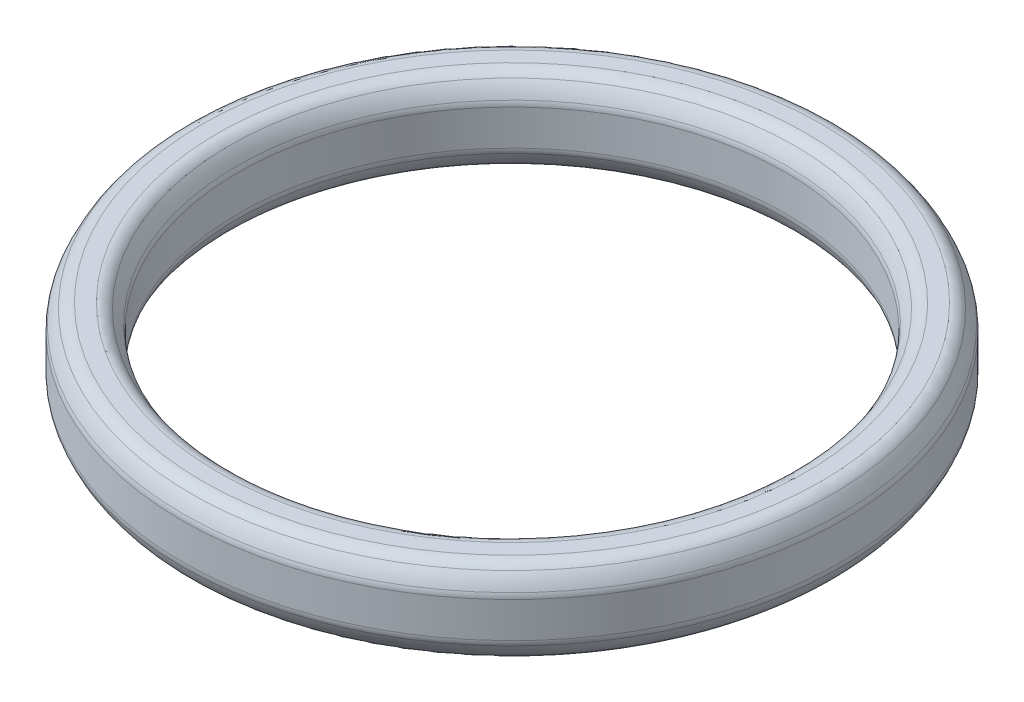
ISO-10303-21;
HEADER;
FILE_DESCRIPTION(('STEP AP214'),'2;1');
FILE_NAME('part.step','',(''),(''),'','','');
FILE_SCHEMA(('AUTOMOTIVE_DESIGN { 1 0 10303 214 1 1 1 1 }'));
ENDSEC;
DATA;
#1=APPLICATION_CONTEXT('core data for automotive mechanical design processes');
#2=APPLICATION_PROTOCOL_DEFINITION('international standard','automotive_design',2000,#1);
#3=PRODUCT_CONTEXT('',#1,'mechanical');
#4=PRODUCT('Part','Part','',(#3));
#5=PRODUCT_RELATED_PRODUCT_CATEGORY('part','',(#4));
#6=PRODUCT_DEFINITION_FORMATION('','',#4);
#7=PRODUCT_DEFINITION_CONTEXT('part definition',#1,'design');
#8=PRODUCT_DEFINITION('design','',#6,#7);
#9=PRODUCT_DEFINITION_SHAPE('','',#8);
#10=(LENGTH_UNIT() NAMED_UNIT(*) SI_UNIT(.MILLI.,.METRE.));
#11=(NAMED_UNIT(*) PLANE_ANGLE_UNIT() SI_UNIT($,.RADIAN.));
#12=(NAMED_UNIT(*) SI_UNIT($,.STERADIAN.) SOLID_ANGLE_UNIT());
#13=UNCERTAINTY_MEASURE_WITH_UNIT(LENGTH_MEASURE(1.E-05),#10,'distance_accuracy_value','');
#14=(GEOMETRIC_REPRESENTATION_CONTEXT(3) GLOBAL_UNCERTAINTY_ASSIGNED_CONTEXT((#13)) GLOBAL_UNIT_ASSIGNED_CONTEXT((#10,
#11,#12)) REPRESENTATION_CONTEXT('',''));
#15=CARTESIAN_POINT('',(0.,0.,0.));
#16=DIRECTION('',(0.,0.,1.));
#17=DIRECTION('',(1.,0.,0.));
#18=AXIS2_PLACEMENT_3D('',#15,#16,#17);
#19=CARTESIAN_POINT('',(15.5375,2.16,0.));
#20=DIRECTION('',(0.,0.,1.));
#21=DIRECTION('',(0.,-1.,0.));
#22=AXIS2_PLACEMENT_3D('',#19,#20,#21);
#23=ELLIPSE('',#22,2.4,1.59722222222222);
#24=CARTESIAN_POINT('',(0.,0.,0.));
#25=DIRECTION('',(0.,-1.,0.));
#26=AXIS1_PLACEMENT('',#24,#25);
#27=SURFACE_OF_REVOLUTION('',#23,#26);
#28=CARTESIAN_POINT('',(0.,4.04948495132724,0.));
#29=DIRECTION('',(0.,-1.,0.));
#30=DIRECTION('',(0.,0.,-1.));
#31=AXIS2_PLACEMENT_3D('',#28,#29,#30);
#32=CIRCLE('',#31,16.5223292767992);
#33=CARTESIAN_POINT('',(0.,4.04948495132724,-16.5223292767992));
#34=VERTEX_POINT('',#33);
#35=EDGE_CURVE('E64',#34,#34,#32,.T.);
#36=ORIENTED_EDGE('',*,*,#35,.T.);
#37=EDGE_LOOP('',(#36));
#38=FACE_BOUND('',#37,.T.);
#39=CARTESIAN_POINT('',(0.,3.34858375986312,0.));
#40=DIRECTION('',(0.,-1.,0.));
#41=DIRECTION('',(0.,0.,-1.));
#42=AXIS2_PLACEMENT_3D('',#39,#40,#41);
#43=CIRCLE('',#42,16.9250937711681);
#44=CARTESIAN_POINT('',(0.,3.34858375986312,-16.9250937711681));
#45=VERTEX_POINT('',#44);
#46=EDGE_CURVE('E67',#45,#45,#43,.F.);
#47=ORIENTED_EDGE('',*,*,#46,.T.);
#48=EDGE_LOOP('',(#47));
#49=FACE_BOUND('',#48,.T.);
#50=ADVANCED_FACE('F14',(#38,#49),#27,.F.);
#51=CARTESIAN_POINT('',(14.8412869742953,4.31999999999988,0.));
#52=DIRECTION('',(0.,1.,0.));
#53=DIRECTION('',(0.,0.,1.));
#54=AXIS2_PLACEMENT_3D('',#51,#52,#53);
#55=PLANE('',#54);
#56=CARTESIAN_POINT('',(0.,4.31999999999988,0.));
#57=DIRECTION('',(0.,1.,0.));
#58=DIRECTION('',(0.,0.,1.));
#59=AXIS2_PLACEMENT_3D('',#56,#57,#58);
#60=CIRCLE('',#59,15.9374684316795);
#61=CARTESIAN_POINT('',(0.,4.31999999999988,15.9374684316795));
#62=VERTEX_POINT('',#61);
#63=EDGE_CURVE('E58',#62,#62,#60,.T.);
#64=ORIENTED_EDGE('',*,*,#63,.T.);
#65=EDGE_LOOP('',(#64));
#66=FACE_BOUND('',#65,.T.);
#67=CARTESIAN_POINT('',(0.,4.31999999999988,0.));
#68=DIRECTION('',(0.,1.,0.));
#69=DIRECTION('',(0.,0.,1.));
#70=AXIS2_PLACEMENT_3D('',#67,#68,#69);
#71=CIRCLE('',#70,15.1375315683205);
#72=CARTESIAN_POINT('',(0.,4.31999999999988,15.1375315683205));
#73=VERTEX_POINT('',#72);
#74=EDGE_CURVE('E61',#73,#73,#71,.F.);
#75=ORIENTED_EDGE('',*,*,#74,.T.);
#76=EDGE_LOOP('',(#75));
#77=FACE_BOUND('',#76,.T.);
#78=ADVANCED_FACE('F96',(#66,#77),#55,.T.);
#79=CARTESIAN_POINT('',(15.5375,2.16,0.));
#80=DIRECTION('',(0.,0.,1.));
#81=DIRECTION('',(0.,-1.,0.));
#82=AXIS2_PLACEMENT_3D('',#79,#80,#81);
#83=ELLIPSE('',#82,2.4,1.59722222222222);
#84=CARTESIAN_POINT('',(0.,0.,0.));
#85=DIRECTION('',(0.,-1.,0.));
#86=AXIS1_PLACEMENT('',#84,#85);
#87=SURFACE_OF_REVOLUTION('',#83,#86);
#88=CARTESIAN_POINT('',(0.,4.04948495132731,0.));
#89=DIRECTION('',(0.,-1.,0.));
#90=DIRECTION('',(0.,0.,-1.));
#91=AXIS2_PLACEMENT_3D('',#88,#89,#90);
#92=CIRCLE('',#91,14.5526707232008);
#93=CARTESIAN_POINT('',(0.,4.04948495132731,-14.5526707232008));
#94=VERTEX_POINT('',#93);
#95=EDGE_CURVE('E52',#94,#94,#92,.F.);
#96=ORIENTED_EDGE('',*,*,#95,.T.);
#97=EDGE_LOOP('',(#96));
#98=FACE_BOUND('',#97,.T.);
#99=CARTESIAN_POINT('',(0.,3.34858375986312,0.));
#100=DIRECTION('',(0.,-1.,0.));
#101=DIRECTION('',(0.,0.,-1.));
#102=AXIS2_PLACEMENT_3D('',#99,#100,#101);
#103=CIRCLE('',#102,14.1499062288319);
#104=CARTESIAN_POINT('',(0.,3.34858375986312,-14.1499062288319));
#105=VERTEX_POINT('',#104);
#106=EDGE_CURVE('E55',#105,#105,#103,.T.);
#107=ORIENTED_EDGE('',*,*,#106,.T.);
#108=EDGE_LOOP('',(#107));
#109=FACE_BOUND('',#108,.T.);
#110=ADVANCED_FACE('F92',(#98,#109),#87,.F.);
#111=CARTESIAN_POINT('',(0.,0.,0.));
#112=DIRECTION('',(0.,-1.,0.));
#113=DIRECTION('',(0.,0.,-1.));
#114=AXIS2_PLACEMENT_3D('',#111,#112,#113);
#115=CYLINDRICAL_SURFACE('',#114,14.1);
#116=CARTESIAN_POINT('',(0.,3.07634226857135,0.));
#117=DIRECTION('',(0.,1.,0.));
#118=DIRECTION('',(0.,0.,1.));
#119=AXIS2_PLACEMENT_3D('',#116,#117,#118);
#120=CIRCLE('',#119,14.1);
#121=CARTESIAN_POINT('',(0.,3.07634226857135,14.1));
#122=VERTEX_POINT('',#121);
#123=EDGE_CURVE('E46',#122,#122,#120,.T.);
#124=ORIENTED_EDGE('',*,*,#123,.T.);
#125=EDGE_LOOP('',(#124));
#126=FACE_BOUND('',#125,.T.);
#127=CARTESIAN_POINT('',(0.,1.24365773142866,0.));
#128=DIRECTION('',(0.,1.,0.));
#129=DIRECTION('',(0.,0.,1.));
#130=AXIS2_PLACEMENT_3D('',#127,#128,#129);
#131=CIRCLE('',#130,14.1);
#132=CARTESIAN_POINT('',(0.,1.24365773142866,14.1));
#133=VERTEX_POINT('',#132);
#134=EDGE_CURVE('E49',#133,#133,#131,.F.);
#135=ORIENTED_EDGE('',*,*,#134,.T.);
#136=EDGE_LOOP('',(#135));
#137=FACE_BOUND('',#136,.T.);
#138=ADVANCED_FACE('F88',(#126,#137),#115,.F.);
#139=CARTESIAN_POINT('',(15.5375,2.16,0.));
#140=DIRECTION('',(0.,0.,1.));
#141=DIRECTION('',(0.,-1.,0.));
#142=AXIS2_PLACEMENT_3D('',#139,#140,#141);
#143=ELLIPSE('',#142,2.4,1.59722222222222);
#144=CARTESIAN_POINT('',(0.,0.,0.));
#145=DIRECTION('',(0.,-1.,0.));
#146=AXIS1_PLACEMENT('',#144,#145);
#147=SURFACE_OF_REVOLUTION('',#143,#146);
#148=CARTESIAN_POINT('',(0.,0.971416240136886,0.));
#149=DIRECTION('',(0.,-1.,0.));
#150=DIRECTION('',(0.,0.,-1.));
#151=AXIS2_PLACEMENT_3D('',#148,#149,#150);
#152=CIRCLE('',#151,14.1499062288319);
#153=CARTESIAN_POINT('',(0.,0.971416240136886,-14.1499062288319));
#154=VERTEX_POINT('',#153);
#155=EDGE_CURVE('E40',#154,#154,#152,.F.);
#156=ORIENTED_EDGE('',*,*,#155,.T.);
#157=EDGE_LOOP('',(#156));
#158=FACE_BOUND('',#157,.T.);
#159=CARTESIAN_POINT('',(0.,0.270515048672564,0.));
#160=DIRECTION('',(0.,-1.,0.));
#161=DIRECTION('',(0.,0.,-1.));
#162=AXIS2_PLACEMENT_3D('',#159,#160,#161);
#163=CIRCLE('',#162,14.5526707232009);
#164=CARTESIAN_POINT('',(0.,0.270515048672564,-14.5526707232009));
#165=VERTEX_POINT('',#164);
#166=EDGE_CURVE('E43',#165,#165,#163,.T.);
#167=ORIENTED_EDGE('',*,*,#166,.T.);
#168=EDGE_LOOP('',(#167));
#169=FACE_BOUND('',#168,.T.);
#170=ADVANCED_FACE('F84',(#158,#169),#147,.F.);
#171=CARTESIAN_POINT('',(14.8412869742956,0.,0.));
#172=DIRECTION('',(0.,-1.,0.));
#173=DIRECTION('',(0.,0.,-1.));
#174=AXIS2_PLACEMENT_3D('',#171,#172,#173);
#175=PLANE('',#174);
#176=CARTESIAN_POINT('',(0.,0.,0.));
#177=DIRECTION('',(0.,-1.,0.));
#178=DIRECTION('',(0.,0.,-1.));
#179=AXIS2_PLACEMENT_3D('',#176,#177,#178);
#180=CIRCLE('',#179,15.1375315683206);
#181=CARTESIAN_POINT('',(0.,0.,-15.1375315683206));
#182=VERTEX_POINT('',#181);
#183=EDGE_CURVE('E34',#182,#182,#180,.F.);
#184=ORIENTED_EDGE('',*,*,#183,.T.);
#185=EDGE_LOOP('',(#184));
#186=FACE_BOUND('',#185,.T.);
#187=CARTESIAN_POINT('',(0.,0.,0.));
#188=DIRECTION('',(0.,-1.,0.));
#189=DIRECTION('',(0.,0.,-1.));
#190=AXIS2_PLACEMENT_3D('',#187,#188,#189);
#191=CIRCLE('',#190,15.9374684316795);
#192=CARTESIAN_POINT('',(0.,0.,-15.9374684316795));
#193=VERTEX_POINT('',#192);
#194=EDGE_CURVE('E37',#193,#193,#191,.T.);
#195=ORIENTED_EDGE('',*,*,#194,.T.);
#196=EDGE_LOOP('',(#195));
#197=FACE_BOUND('',#196,.T.);
#198=ADVANCED_FACE('F80',(#186,#197),#175,.T.);
#199=CARTESIAN_POINT('',(15.5375,2.16,0.));
#200=DIRECTION('',(0.,0.,1.));
#201=DIRECTION('',(0.,-1.,0.));
#202=AXIS2_PLACEMENT_3D('',#199,#200,#201);
#203=ELLIPSE('',#202,2.4,1.59722222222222);
#204=CARTESIAN_POINT('',(0.,0.,0.));
#205=DIRECTION('',(0.,-1.,0.));
#206=AXIS1_PLACEMENT('',#204,#205);
#207=SURFACE_OF_REVOLUTION('',#203,#206);
#208=CARTESIAN_POINT('',(0.,0.270515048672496,0.));
#209=DIRECTION('',(0.,-1.,0.));
#210=DIRECTION('',(0.,0.,-1.));
#211=AXIS2_PLACEMENT_3D('',#208,#209,#210);
#212=CIRCLE('',#211,16.522329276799);
#213=CARTESIAN_POINT('',(0.,0.270515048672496,-16.522329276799));
#214=VERTEX_POINT('',#213);
#215=EDGE_CURVE('E25',#214,#214,#212,.F.);
#216=ORIENTED_EDGE('',*,*,#215,.T.);
#217=EDGE_LOOP('',(#216));
#218=FACE_BOUND('',#217,.T.);
#219=CARTESIAN_POINT('',(0.,0.971416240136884,0.));
#220=DIRECTION('',(0.,-1.,0.));
#221=DIRECTION('',(0.,0.,-1.));
#222=AXIS2_PLACEMENT_3D('',#219,#220,#221);
#223=CIRCLE('',#222,16.9250937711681);
#224=CARTESIAN_POINT('',(0.,0.971416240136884,-16.9250937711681));
#225=VERTEX_POINT('',#224);
#226=EDGE_CURVE('E29',#225,#225,#223,.T.);
#227=ORIENTED_EDGE('',*,*,#226,.T.);
#228=EDGE_LOOP('',(#227));
#229=FACE_BOUND('',#228,.T.);
#230=ADVANCED_FACE('F75',(#218,#229),#207,.F.);
#231=CARTESIAN_POINT('',(0.,0.,0.));
#232=DIRECTION('',(0.,-1.,0.));
#233=DIRECTION('',(0.,0.,-1.));
#234=AXIS2_PLACEMENT_3D('',#231,#232,#233);
#235=CYLINDRICAL_SURFACE('',#234,16.975);
#236=CARTESIAN_POINT('',(0.,1.24365773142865,0.));
#237=DIRECTION('',(0.,1.,0.));
#238=DIRECTION('',(0.,0.,1.));
#239=AXIS2_PLACEMENT_3D('',#236,#237,#238);
#240=CIRCLE('',#239,16.975);
#241=CARTESIAN_POINT('',(0.,1.24365773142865,16.975));
#242=VERTEX_POINT('',#241);
#243=EDGE_CURVE('E10',#242,#242,#240,.T.);
#244=ORIENTED_EDGE('',*,*,#243,.T.);
#245=EDGE_LOOP('',(#244));
#246=FACE_BOUND('',#245,.T.);
#247=CARTESIAN_POINT('',(0.,3.07634226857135,0.));
#248=DIRECTION('',(0.,1.,0.));
#249=DIRECTION('',(0.,0.,1.));
#250=AXIS2_PLACEMENT_3D('',#247,#248,#249);
#251=CIRCLE('',#250,16.975);
#252=CARTESIAN_POINT('',(0.,3.07634226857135,16.975));
#253=VERTEX_POINT('',#252);
#254=EDGE_CURVE('E21',#253,#253,#251,.F.);
#255=ORIENTED_EDGE('',*,*,#254,.T.);
#256=EDGE_LOOP('',(#255));
#257=FACE_BOUND('',#256,.T.);
#258=ADVANCED_FACE('F79',(#246,#257),#235,.T.);
#259=CARTESIAN_POINT('',(0.,3.55249999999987,0.));
#260=DIRECTION('',(0.,-1.,0.));
#261=DIRECTION('',(0.,0.,-1.));
#262=AXIS2_PLACEMENT_3D('',#259,#260,#261);
#263=TOROIDAL_SURFACE('',#262,15.9374684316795,0.7675);
#264=ORIENTED_EDGE('',*,*,#63,.F.);
#265=EDGE_LOOP('',(#264));
#266=FACE_BOUND('',#265,.T.);
#267=ORIENTED_EDGE('',*,*,#35,.F.);
#268=EDGE_LOOP('',(#267));
#269=FACE_BOUND('',#268,.T.);
#270=ADVANCED_FACE('F105',(#266,#269),#263,.T.);
#271=CARTESIAN_POINT('',(0.,3.55249999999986,0.));
#272=DIRECTION('',(0.,-1.,0.));
#273=DIRECTION('',(0.,0.,-1.));
#274=AXIS2_PLACEMENT_3D('',#271,#272,#273);
#275=TOROIDAL_SURFACE('',#274,15.1375315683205,0.7675);
#276=ORIENTED_EDGE('',*,*,#95,.F.);
#277=EDGE_LOOP('',(#276));
#278=FACE_BOUND('',#277,.T.);
#279=ORIENTED_EDGE('',*,*,#74,.F.);
#280=EDGE_LOOP('',(#279));
#281=FACE_BOUND('',#280,.T.);
#282=ADVANCED_FACE('F108',(#278,#281),#275,.T.);
#283=CARTESIAN_POINT('',(0.,3.07634226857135,0.));
#284=DIRECTION('',(0.,1.,0.));
#285=DIRECTION('',(0.,0.,1.));
#286=AXIS2_PLACEMENT_3D('',#283,#284,#285);
#287=TOROIDAL_SURFACE('',#286,14.8675,0.7675);
#288=ORIENTED_EDGE('',*,*,#123,.F.);
#289=EDGE_LOOP('',(#288));
#290=FACE_BOUND('',#289,.T.);
#291=ORIENTED_EDGE('',*,*,#106,.F.);
#292=EDGE_LOOP('',(#291));
#293=FACE_BOUND('',#292,.T.);
#294=ADVANCED_FACE('F112',(#290,#293),#287,.T.);
#295=CARTESIAN_POINT('',(0.,1.24365773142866,0.));
#296=DIRECTION('',(0.,1.,0.));
#297=DIRECTION('',(0.,0.,1.));
#298=AXIS2_PLACEMENT_3D('',#295,#296,#297);
#299=TOROIDAL_SURFACE('',#298,14.8675,0.7675);
#300=ORIENTED_EDGE('',*,*,#155,.F.);
#301=EDGE_LOOP('',(#300));
#302=FACE_BOUND('',#301,.T.);
#303=ORIENTED_EDGE('',*,*,#134,.F.);
#304=EDGE_LOOP('',(#303));
#305=FACE_BOUND('',#304,.T.);
#306=ADVANCED_FACE('F116',(#302,#305),#299,.T.);
#307=CARTESIAN_POINT('',(0.,0.767500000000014,0.));
#308=DIRECTION('',(0.,-1.,0.));
#309=DIRECTION('',(0.,0.,-1.));
#310=AXIS2_PLACEMENT_3D('',#307,#308,#309);
#311=TOROIDAL_SURFACE('',#310,15.1375315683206,0.7675);
#312=ORIENTED_EDGE('',*,*,#183,.F.);
#313=EDGE_LOOP('',(#312));
#314=FACE_BOUND('',#313,.T.);
#315=ORIENTED_EDGE('',*,*,#166,.F.);
#316=EDGE_LOOP('',(#315));
#317=FACE_BOUND('',#316,.T.);
#318=ADVANCED_FACE('F120',(#314,#317),#311,.T.);
#319=CARTESIAN_POINT('',(0.,0.767500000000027,0.));
#320=DIRECTION('',(0.,-1.,0.));
#321=DIRECTION('',(0.,0.,-1.));
#322=AXIS2_PLACEMENT_3D('',#319,#320,#321);
#323=TOROIDAL_SURFACE('',#322,15.9374684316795,0.7675);
#324=ORIENTED_EDGE('',*,*,#215,.F.);
#325=EDGE_LOOP('',(#324));
#326=FACE_BOUND('',#325,.T.);
#327=ORIENTED_EDGE('',*,*,#194,.F.);
#328=EDGE_LOOP('',(#327));
#329=FACE_BOUND('',#328,.T.);
#330=ADVANCED_FACE('F124',(#326,#329),#323,.T.);
#331=CARTESIAN_POINT('',(0.,1.24365773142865,0.));
#332=DIRECTION('',(0.,1.,0.));
#333=DIRECTION('',(0.,0.,1.));
#334=AXIS2_PLACEMENT_3D('',#331,#332,#333);
#335=TOROIDAL_SURFACE('',#334,16.2075,0.7675);
#336=ORIENTED_EDGE('',*,*,#243,.F.);
#337=EDGE_LOOP('',(#336));
#338=FACE_BOUND('',#337,.T.);
#339=ORIENTED_EDGE('',*,*,#226,.F.);
#340=EDGE_LOOP('',(#339));
#341=FACE_BOUND('',#340,.T.);
#342=ADVANCED_FACE('F127',(#338,#341),#335,.T.);
#343=CARTESIAN_POINT('',(0.,3.07634226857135,0.));
#344=DIRECTION('',(0.,1.,0.));
#345=DIRECTION('',(0.,0.,1.));
#346=AXIS2_PLACEMENT_3D('',#343,#344,#345);
#347=TOROIDAL_SURFACE('',#346,16.2075,0.7675);
#348=ORIENTED_EDGE('',*,*,#46,.F.);
#349=EDGE_LOOP('',(#348));
#350=FACE_BOUND('',#349,.T.);
#351=ORIENTED_EDGE('',*,*,#254,.F.);
#352=EDGE_LOOP('',(#351));
#353=FACE_BOUND('',#352,.T.);
#354=ADVANCED_FACE('F16',(#350,#353),#347,.T.);
#355=CLOSED_SHELL('',(#50,#78,#110,#138,#170,#198,#230,#258,#270,#282,#294,#306,#318,#330,#342,#354));
#356=MANIFOLD_SOLID_BREP('B1',#355);
#357=ADVANCED_BREP_SHAPE_REPRESENTATION('',(#18,#356),#14);
#358=SHAPE_DEFINITION_REPRESENTATION(#9,#357);
ENDSEC;
END-ISO-10303-21;
